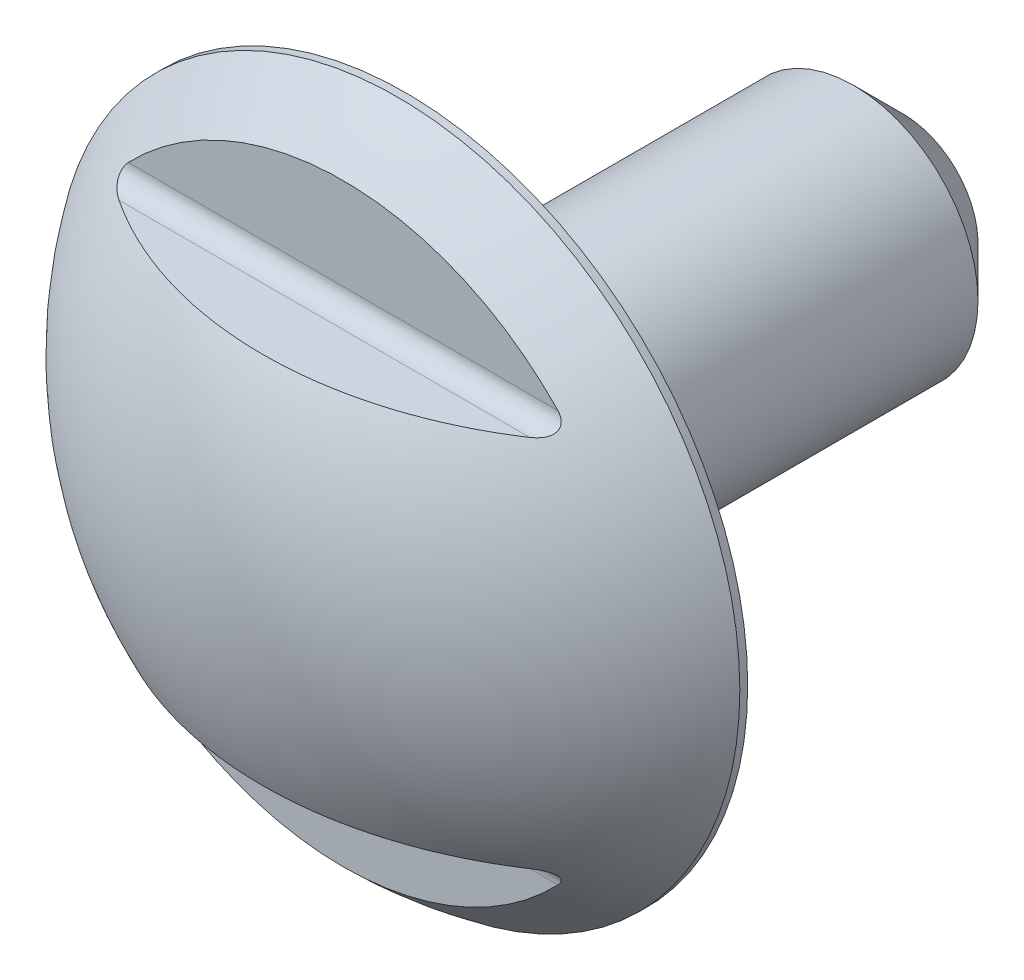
ISO-10303-21;
HEADER;
FILE_DESCRIPTION(('STEP AP214'),'2;1');
FILE_NAME('part.step','',(''),(''),'','','');
FILE_SCHEMA(('AUTOMOTIVE_DESIGN { 1 0 10303 214 1 1 1 1 }'));
ENDSEC;
DATA;
#1=APPLICATION_CONTEXT('core data for automotive mechanical design processes');
#2=APPLICATION_PROTOCOL_DEFINITION('international standard','automotive_design',2000,#1);
#3=PRODUCT_CONTEXT('',#1,'mechanical');
#4=PRODUCT('Part','Part','',(#3));
#5=PRODUCT_RELATED_PRODUCT_CATEGORY('part','',(#4));
#6=PRODUCT_DEFINITION_FORMATION('','',#4);
#7=PRODUCT_DEFINITION_CONTEXT('part definition',#1,'design');
#8=PRODUCT_DEFINITION('design','',#6,#7);
#9=PRODUCT_DEFINITION_SHAPE('','',#8);
#10=(LENGTH_UNIT() NAMED_UNIT(*) SI_UNIT(.MILLI.,.METRE.));
#11=(NAMED_UNIT(*) PLANE_ANGLE_UNIT() SI_UNIT($,.RADIAN.));
#12=(NAMED_UNIT(*) SI_UNIT($,.STERADIAN.) SOLID_ANGLE_UNIT());
#13=UNCERTAINTY_MEASURE_WITH_UNIT(LENGTH_MEASURE(1.E-05),#10,'distance_accuracy_value','');
#14=(GEOMETRIC_REPRESENTATION_CONTEXT(3) GLOBAL_UNCERTAINTY_ASSIGNED_CONTEXT((#13)) GLOBAL_UNIT_ASSIGNED_CONTEXT((#10,
#11,#12)) REPRESENTATION_CONTEXT('',''));
#15=CARTESIAN_POINT('',(0.,0.,0.));
#16=DIRECTION('',(0.,0.,1.));
#17=DIRECTION('',(1.,0.,0.));
#18=AXIS2_PLACEMENT_3D('',#15,#16,#17);
#19=CARTESIAN_POINT('',(0.,0.,-6.));
#20=DIRECTION('',(0.,0.,-1.));
#21=DIRECTION('',(1.,0.,0.));
#22=AXIS2_PLACEMENT_3D('',#19,#20,#21);
#23=CYLINDRICAL_SURFACE('',#22,5.5);
#24=CARTESIAN_POINT('',(0.,0.,0.));
#25=DIRECTION('',(0.,0.,-1.));
#26=DIRECTION('',(1.,0.,0.));
#27=AXIS2_PLACEMENT_3D('',#24,#25,#26);
#28=CIRCLE('',#27,5.5);
#29=CARTESIAN_POINT('',(5.5,0.,0.));
#30=VERTEX_POINT('',#29);
#31=EDGE_CURVE('E59',#30,#30,#28,.T.);
#32=ORIENTED_EDGE('',*,*,#31,.F.);
#33=EDGE_LOOP('',(#32));
#34=FACE_BOUND('',#33,.T.);
#35=CARTESIAN_POINT('',(0.,0.,0.126225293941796));
#36=DIRECTION('',(0.,0.,1.));
#37=DIRECTION('',(-1.,0.,0.));
#38=AXIS2_PLACEMENT_3D('',#35,#36,#37);
#39=CIRCLE('',#38,5.5);
#40=CARTESIAN_POINT('',(-5.5,0.,0.126225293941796));
#41=VERTEX_POINT('',#40);
#42=EDGE_CURVE('E144',#41,#41,#39,.T.);
#43=ORIENTED_EDGE('',*,*,#42,.F.);
#44=EDGE_LOOP('',(#43));
#45=FACE_BOUND('',#44,.T.);
#46=ADVANCED_FACE('F14',(#34,#45),#23,.T.);
#47=CARTESIAN_POINT('',(0.,-5.5,0.));
#48=DIRECTION('',(0.,0.,1.));
#49=DIRECTION('',(-1.,0.,0.));
#50=AXIS2_PLACEMENT_3D('',#47,#48,#49);
#51=PLANE('',#50);
#52=CARTESIAN_POINT('',(0.,0.,0.));
#53=DIRECTION('',(0.,0.,-1.));
#54=DIRECTION('',(1.,0.,0.));
#55=AXIS2_PLACEMENT_3D('',#52,#53,#54);
#56=CIRCLE('',#55,1.85);
#57=CARTESIAN_POINT('',(1.85,0.,0.));
#58=VERTEX_POINT('',#57);
#59=EDGE_CURVE('E158',#58,#58,#56,.T.);
#60=ORIENTED_EDGE('',*,*,#59,.F.);
#61=EDGE_LOOP('',(#60));
#62=FACE_BOUND('',#61,.T.);
#63=ORIENTED_EDGE('',*,*,#31,.T.);
#64=EDGE_LOOP('',(#63));
#65=FACE_BOUND('',#64,.T.);
#66=ADVANCED_FACE('F106',(#62,#65),#51,.F.);
#67=CARTESIAN_POINT('',(0.,0.,-0.4));
#68=DIRECTION('',(0.,0.,-1.));
#69=DIRECTION('',(1.,0.,0.));
#70=AXIS2_PLACEMENT_3D('',#67,#68,#69);
#71=TOROIDAL_SURFACE('',#70,1.85,0.4);
#72=CARTESIAN_POINT('',(0.,0.,-0.4));
#73=DIRECTION('',(0.,0.,-1.));
#74=DIRECTION('',(1.,0.,0.));
#75=AXIS2_PLACEMENT_3D('',#72,#73,#74);
#76=CIRCLE('',#75,1.45);
#77=CARTESIAN_POINT('',(1.45,0.,-0.4));
#78=VERTEX_POINT('',#77);
#79=EDGE_CURVE('E155',#78,#78,#76,.T.);
#80=ORIENTED_EDGE('',*,*,#79,.F.);
#81=EDGE_LOOP('',(#80));
#82=FACE_BOUND('',#81,.T.);
#83=ORIENTED_EDGE('',*,*,#59,.T.);
#84=EDGE_LOOP('',(#83));
#85=FACE_BOUND('',#84,.T.);
#86=ADVANCED_FACE('F111',(#82,#85),#71,.F.);
#87=CARTESIAN_POINT('',(0.,0.,-6.));
#88=DIRECTION('',(0.,0.,-1.));
#89=DIRECTION('',(1.,0.,0.));
#90=AXIS2_PLACEMENT_3D('',#87,#88,#89);
#91=CYLINDRICAL_SURFACE('',#90,1.45);
#92=CARTESIAN_POINT('',(0.,0.,-0.440192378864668));
#93=DIRECTION('',(0.,0.,-1.));
#94=DIRECTION('',(1.,0.,0.));
#95=AXIS2_PLACEMENT_3D('',#92,#93,#94);
#96=CIRCLE('',#95,1.45);
#97=CARTESIAN_POINT('',(1.45,0.,-0.440192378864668));
#98=VERTEX_POINT('',#97);
#99=EDGE_CURVE('E147',#98,#98,#96,.T.);
#100=ORIENTED_EDGE('',*,*,#99,.F.);
#101=EDGE_LOOP('',(#100));
#102=FACE_BOUND('',#101,.T.);
#103=ORIENTED_EDGE('',*,*,#79,.T.);
#104=EDGE_LOOP('',(#103));
#105=FACE_BOUND('',#104,.T.);
#106=ADVANCED_FACE('F119',(#102,#105),#91,.T.);
#107=CARTESIAN_POINT('',(0.,0.,-0.44019237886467));
#108=DIRECTION('',(0.,0.,-1.));
#109=DIRECTION('',(1.,0.,0.));
#110=AXIS2_PLACEMENT_3D('',#107,#108,#109);
#111=TOROIDAL_SURFACE('',#110,1.85,0.399999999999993);
#112=CARTESIAN_POINT('',(0.,0.,-0.640192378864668));
#113=DIRECTION('',(0.,0.,-1.));
#114=DIRECTION('',(1.,0.,0.));
#115=AXIS2_PLACEMENT_3D('',#112,#113,#114);
#116=CIRCLE('',#115,1.50358983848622);
#117=CARTESIAN_POINT('',(1.50358983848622,0.,-0.640192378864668));
#118=VERTEX_POINT('',#117);
#119=EDGE_CURVE('E143',#118,#118,#116,.T.);
#120=ORIENTED_EDGE('',*,*,#119,.F.);
#121=EDGE_LOOP('',(#120));
#122=FACE_BOUND('',#121,.T.);
#123=ORIENTED_EDGE('',*,*,#99,.T.);
#124=EDGE_LOOP('',(#123));
#125=FACE_BOUND('',#124,.T.);
#126=ADVANCED_FACE('F123',(#122,#125),#111,.F.);
#127=CARTESIAN_POINT('',(0.,0.,-0.640192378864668));
#128=DIRECTION('',(0.,0.,-1.));
#129=DIRECTION('',(1.,0.,0.));
#130=AXIS2_PLACEMENT_3D('',#127,#128,#129);
#131=CONICAL_SURFACE('',#130,1.50358983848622,0.523598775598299);
#132=CARTESIAN_POINT('',(0.,0.,-1.5));
#133=DIRECTION('',(0.,0.,-1.));
#134=DIRECTION('',(1.,0.,0.));
#135=AXIS2_PLACEMENT_3D('',#132,#133,#134);
#136=CIRCLE('',#135,2.);
#137=CARTESIAN_POINT('',(2.,0.,-1.5));
#138=VERTEX_POINT('',#137);
#139=EDGE_CURVE('E142',#138,#138,#136,.T.);
#140=ORIENTED_EDGE('',*,*,#139,.F.);
#141=EDGE_LOOP('',(#140));
#142=FACE_BOUND('',#141,.T.);
#143=ORIENTED_EDGE('',*,*,#119,.T.);
#144=EDGE_LOOP('',(#143));
#145=FACE_BOUND('',#144,.T.);
#146=ADVANCED_FACE('F127',(#142,#145),#131,.T.);
#147=CARTESIAN_POINT('',(0.,0.,-6.));
#148=DIRECTION('',(0.,0.,-1.));
#149=DIRECTION('',(1.,0.,0.));
#150=AXIS2_PLACEMENT_3D('',#147,#148,#149);
#151=CYLINDRICAL_SURFACE('',#150,2.);
#152=CARTESIAN_POINT('',(0.,0.,-7.2));
#153=DIRECTION('',(0.,0.,-1.));
#154=DIRECTION('',(-1.,0.,0.));
#155=AXIS2_PLACEMENT_3D('',#152,#153,#154);
#156=CIRCLE('',#155,2.);
#157=CARTESIAN_POINT('',(-2.,0.,-7.2));
#158=VERTEX_POINT('',#157);
#159=EDGE_CURVE('E9',#158,#158,#156,.F.);
#160=ORIENTED_EDGE('',*,*,#159,.T.);
#161=EDGE_LOOP('',(#160));
#162=FACE_BOUND('',#161,.T.);
#163=ORIENTED_EDGE('',*,*,#139,.T.);
#164=EDGE_LOOP('',(#163));
#165=FACE_BOUND('',#164,.T.);
#166=ADVANCED_FACE('F130',(#162,#165),#151,.T.);
#167=CARTESIAN_POINT('',(0.,0.,-3.7));
#168=DIRECTION('',(0.,0.,1.));
#169=DIRECTION('',(0.,-1.,0.));
#170=AXIS2_PLACEMENT_3D('',#167,#168,#169);
#171=SPHERICAL_SURFACE('',#170,6.7);
#172=CARTESIAN_POINT('',(0.,3.,-3.7));
#173=DIRECTION('',(0.,-1.,0.));
#174=DIRECTION('',(0.,0.,1.));
#175=AXIS2_PLACEMENT_3D('',#172,#173,#174);
#176=CIRCLE('',#175,5.99082632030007);
#177=CARTESIAN_POINT('',(-3.3,3.,1.3));
#178=VERTEX_POINT('',#177);
#179=CARTESIAN_POINT('',(3.3,3.,1.3));
#180=VERTEX_POINT('',#179);
#181=EDGE_CURVE('E175',#178,#180,#176,.F.);
#182=ORIENTED_EDGE('',*,*,#181,.F.);
#183=CARTESIAN_POINT('',(-3.45089543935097,3.3002,1.00000006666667));
#184=CARTESIAN_POINT('',(-3.46018087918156,3.29048831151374,1.00000237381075));
#185=CARTESIAN_POINT('',(-3.46914612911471,3.28037875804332,1.00045993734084));
#186=CARTESIAN_POINT('',(-3.48611932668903,3.25927546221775,1.00258239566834));
#187=CARTESIAN_POINT('',(-3.49411182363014,3.24827117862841,1.0042643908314));
#188=CARTESIAN_POINT('',(-3.50706084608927,3.2278869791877,1.00865037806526));
#189=CARTESIAN_POINT('',(-3.51230406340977,3.21863403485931,1.01107565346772));
#190=CARTESIAN_POINT('',(-3.52144320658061,3.19986480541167,1.01703507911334));
#191=CARTESIAN_POINT('',(-3.52534582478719,3.19035009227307,1.0205635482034));
#192=CARTESIAN_POINT('',(-3.53092309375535,3.17302031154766,1.0280654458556));
#193=CARTESIAN_POINT('',(-3.53287341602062,3.16520988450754,1.03184218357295));
#194=CARTESIAN_POINT('',(-3.53549615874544,3.14978225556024,1.04017058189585));
#195=CARTESIAN_POINT('',(-3.53616853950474,3.1421650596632,1.04472226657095));
#196=CARTESIAN_POINT('',(-3.53617075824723,3.12736045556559,1.05449173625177));
#197=CARTESIAN_POINT('',(-3.53549939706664,3.12017343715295,1.05971011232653));
#198=CARTESIAN_POINT('',(-3.53287562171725,3.10643298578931,1.07063337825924));
#199=CARTESIAN_POINT('',(-3.53092247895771,3.09987991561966,1.07633854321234));
#200=CARTESIAN_POINT('',(-3.52529259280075,3.08604577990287,1.08944195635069));
#201=CARTESIAN_POINT('',(-3.52131606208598,3.07896325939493,1.0969197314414));
#202=CARTESIAN_POINT('',(-3.51201340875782,3.06596918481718,1.11203868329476));
#203=CARTESIAN_POINT('',(-3.50668549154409,3.06005920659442,1.11968006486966));
#204=CARTESIAN_POINT('',(-3.49206581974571,3.04659813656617,1.13880050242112));
#205=CARTESIAN_POINT('',(-3.48213266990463,3.03973031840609,1.1502644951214));
#206=CARTESIAN_POINT('',(-3.460749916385,3.02796447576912,1.1728760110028));
#207=CARTESIAN_POINT('',(-3.44929059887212,3.02307995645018,1.18402089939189));
#208=CARTESIAN_POINT('',(-3.42676990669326,3.0153950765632,1.20457526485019));
#209=CARTESIAN_POINT('',(-3.41581348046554,3.01241999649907,1.21403723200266));
#210=CARTESIAN_POINT('',(-3.39333574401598,3.00751675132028,1.23257885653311));
#211=CARTESIAN_POINT('',(-3.38181362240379,3.00559014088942,1.24165792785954));
#212=CARTESIAN_POINT('',(-3.35866326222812,3.00265798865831,1.25919687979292));
#213=CARTESIAN_POINT('',(-3.34704513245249,3.00163031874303,1.26766662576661));
#214=CARTESIAN_POINT('',(-3.32355151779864,3.00030227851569,1.28421487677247));
#215=CARTESIAN_POINT('',(-3.31167705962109,2.99999941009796,1.29229463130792));
#216=CARTESIAN_POINT('',(-3.29969688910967,3.00000006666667,1.3002));
#217=B_SPLINE_CURVE_WITH_KNOTS('',3,(#183,#184,#185,#186,#187,#188,#189,#190,#191,#192,#193,
#194,#195,#196,#197,#198,#199,#200,#201,#202,#203,#204,#205,#206,#207,#208,#209,#210,#211,#212,
#213,#214,#215,#216),.UNSPECIFIED.,.F.,.F.,(4,2,2,2,2,2,2,2,2,2,2,2,2,2,2,2,4),(0.,
0.0403974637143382,0.0813702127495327,0.113978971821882,0.146422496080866,0.172983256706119,
0.199544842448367,0.226130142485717,0.252730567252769,0.28566873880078,0.318650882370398,
0.368325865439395,0.418333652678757,0.462609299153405,0.506950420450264,0.550166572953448,
0.593233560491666),.UNSPECIFIED.);
#218=CARTESIAN_POINT('',(-3.45108678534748,3.3,1.));
#219=VERTEX_POINT('',#218);
#220=EDGE_CURVE('E180',#219,#178,#217,.T.);
#221=ORIENTED_EDGE('',*,*,#220,.F.);
#222=CARTESIAN_POINT('',(0.,0.,1.));
#223=DIRECTION('',(0.,0.,-1.));
#224=DIRECTION('',(0.,-1.,0.));
#225=AXIS2_PLACEMENT_3D('',#222,#223,#224);
#226=CIRCLE('',#225,4.77493455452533);
#227=CARTESIAN_POINT('',(3.45108678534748,3.3,1.));
#228=VERTEX_POINT('',#227);
#229=EDGE_CURVE('E73',#228,#219,#226,.F.);
#230=ORIENTED_EDGE('',*,*,#229,.F.);
#231=CARTESIAN_POINT('',(3.29969688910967,3.00000006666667,1.3002));
#232=CARTESIAN_POINT('',(3.31430711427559,3.00000454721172,1.29055614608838));
#233=CARTESIAN_POINT('',(3.32876926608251,3.00045317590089,1.28065091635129));
#234=CARTESIAN_POINT('',(3.35734920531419,3.00246823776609,1.26021193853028));
#235=CARTESIAN_POINT('',(3.37146290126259,3.00404436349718,1.24967347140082));
#236=CARTESIAN_POINT('',(3.39935085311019,3.00860290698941,1.22778339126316));
#237=CARTESIAN_POINT('',(3.41311009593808,3.01161648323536,1.21641873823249));
#238=CARTESIAN_POINT('',(3.43957104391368,3.01940778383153,1.19314330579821));
#239=CARTESIAN_POINT('',(3.45227673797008,3.02417844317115,1.18123487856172));
#240=CARTESIAN_POINT('',(3.47174047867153,3.03379937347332,1.1613999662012));
#241=CARTESIAN_POINT('',(3.47897095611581,3.03797889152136,1.15361468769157));
#242=CARTESIAN_POINT('',(3.49256263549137,3.0473758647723,1.13793714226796));
#243=CARTESIAN_POINT('',(3.49892598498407,3.05259067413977,1.1300451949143));
#244=CARTESIAN_POINT('',(3.51057224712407,3.06427793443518,1.11416825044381));
#245=CARTESIAN_POINT('',(3.51584074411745,3.07076521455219,1.1061833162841));
#246=CARTESIAN_POINT('',(3.52477894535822,3.08503547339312,1.09047194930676));
#247=CARTESIAN_POINT('',(3.52845172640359,3.09281591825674,1.08274504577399));
#248=CARTESIAN_POINT('',(3.53315073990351,3.10756914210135,1.06968936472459));
#249=CARTESIAN_POINT('',(3.53459973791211,3.11429041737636,1.06422885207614));
#250=CARTESIAN_POINT('',(3.53621492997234,3.1282846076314,1.05385062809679));
#251=CARTESIAN_POINT('',(3.53638173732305,3.13555725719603,1.04893265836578));
#252=CARTESIAN_POINT('',(3.53541714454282,3.15043972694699,1.03979236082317));
#253=CARTESIAN_POINT('',(3.53428616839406,3.15804943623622,1.03556980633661));
#254=CARTESIAN_POINT('',(3.5308278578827,3.17337877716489,1.02789576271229));
#255=CARTESIAN_POINT('',(3.52850021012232,3.18109843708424,1.02444447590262));
#256=CARTESIAN_POINT('',(3.52190588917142,3.19892583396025,1.01732823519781));
#257=CARTESIAN_POINT('',(3.51725673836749,3.20900531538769,1.01394983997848));
#258=CARTESIAN_POINT('',(3.50657915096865,3.22879085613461,1.0083911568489));
#259=CARTESIAN_POINT('',(3.50054441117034,3.23849496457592,1.00621650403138));
#260=CARTESIAN_POINT('',(3.48758435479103,3.25721720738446,1.00291628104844));
#261=CARTESIAN_POINT('',(3.48067533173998,3.26624400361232,1.00177403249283));
#262=CARTESIAN_POINT('',(3.46621678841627,3.28366499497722,1.0003205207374));
#263=CARTESIAN_POINT('',(3.45867581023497,3.29206540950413,0.999999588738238));
#264=CARTESIAN_POINT('',(3.45089543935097,3.3002,1.00000006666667));
#265=B_SPLINE_CURVE_WITH_KNOTS('',3,(#231,#232,#233,#234,#235,#236,#237,#238,#239,#240,#241,
#242,#243,#244,#245,#246,#247,#248,#249,#250,#251,#252,#253,#254,#255,#256,#257,#258,#259,#260,
#261,#262,#263,#264),.UNSPECIFIED.,.F.,.F.,(4,2,2,2,2,2,2,2,2,2,2,2,2,2,2,2,4),(0.,
0.0525412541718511,0.105539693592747,0.15974309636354,0.213730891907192,0.247920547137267,
0.28202392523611,0.316551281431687,0.351011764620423,0.377234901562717,0.403445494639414,
0.429647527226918,0.455856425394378,0.490472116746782,0.525248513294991,0.55945250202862,
0.593251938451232),.UNSPECIFIED.);
#266=EDGE_CURVE('E181',#180,#228,#265,.T.);
#267=ORIENTED_EDGE('',*,*,#266,.F.);
#268=EDGE_LOOP('',(#182,#221,#230,#267));
#269=FACE_BOUND('',#268,.T.);
#270=CARTESIAN_POINT('',(0.,0.,1.));
#271=DIRECTION('',(0.,0.,-1.));
#272=DIRECTION('',(0.,-1.,0.));
#273=AXIS2_PLACEMENT_3D('',#270,#271,#272);
#274=CIRCLE('',#273,4.77493455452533);
#275=CARTESIAN_POINT('',(-3.4510867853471,-3.3,1.));
#276=VERTEX_POINT('',#275);
#277=CARTESIAN_POINT('',(3.45108678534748,-3.3,1.));
#278=VERTEX_POINT('',#277);
#279=EDGE_CURVE('E71',#276,#278,#274,.F.);
#280=ORIENTED_EDGE('',*,*,#279,.F.);
#281=CARTESIAN_POINT('',(-3.29969688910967,-3.00000006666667,1.3002));
#282=CARTESIAN_POINT('',(-3.31430711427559,-3.00000454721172,1.29055614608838));
#283=CARTESIAN_POINT('',(-3.32876926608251,-3.00045317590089,1.2806509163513));
#284=CARTESIAN_POINT('',(-3.35734920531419,-3.00246823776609,1.26021193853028));
#285=CARTESIAN_POINT('',(-3.37146290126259,-3.00404436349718,1.24967347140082));
#286=CARTESIAN_POINT('',(-3.39935085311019,-3.00860290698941,1.22778339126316));
#287=CARTESIAN_POINT('',(-3.41311009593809,-3.01161648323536,1.21641873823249));
#288=CARTESIAN_POINT('',(-3.43957104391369,-3.01940778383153,1.1931433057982));
#289=CARTESIAN_POINT('',(-3.45227673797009,-3.02417844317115,1.18123487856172));
#290=CARTESIAN_POINT('',(-3.47174047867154,-3.03379937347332,1.16139996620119));
#291=CARTESIAN_POINT('',(-3.47897095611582,-3.03797889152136,1.15361468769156));
#292=CARTESIAN_POINT('',(-3.49256263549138,-3.04737586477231,1.13793714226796));
#293=CARTESIAN_POINT('',(-3.49892598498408,-3.05259067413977,1.1300451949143));
#294=CARTESIAN_POINT('',(-3.51057224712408,-3.06427793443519,1.1141682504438));
#295=CARTESIAN_POINT('',(-3.51584074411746,-3.07076521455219,1.10618331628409));
#296=CARTESIAN_POINT('',(-3.52477894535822,-3.08503547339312,1.09047194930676));
#297=CARTESIAN_POINT('',(-3.5284517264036,-3.09281591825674,1.08274504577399));
#298=CARTESIAN_POINT('',(-3.53315073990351,-3.10756914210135,1.06968936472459));
#299=CARTESIAN_POINT('',(-3.53459973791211,-3.11429041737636,1.06422885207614));
#300=CARTESIAN_POINT('',(-3.53621492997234,-3.1282846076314,1.05385062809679));
#301=CARTESIAN_POINT('',(-3.53638173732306,-3.13555725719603,1.04893265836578));
#302=CARTESIAN_POINT('',(-3.53541714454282,-3.150439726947,1.03979236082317));
#303=CARTESIAN_POINT('',(-3.53428616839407,-3.15804943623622,1.03556980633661));
#304=CARTESIAN_POINT('',(-3.5308278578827,-3.17337877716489,1.02789576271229));
#305=CARTESIAN_POINT('',(-3.52850021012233,-3.18109843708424,1.02444447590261));
#306=CARTESIAN_POINT('',(-3.52190588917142,-3.19892583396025,1.0173282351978));
#307=CARTESIAN_POINT('',(-3.5172567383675,-3.20900531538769,1.01394983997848));
#308=CARTESIAN_POINT('',(-3.50657915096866,-3.22879085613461,1.0083911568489));
#309=CARTESIAN_POINT('',(-3.50054441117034,-3.23849496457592,1.00621650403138));
#310=CARTESIAN_POINT('',(-3.48758435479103,-3.25721720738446,1.00291628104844));
#311=CARTESIAN_POINT('',(-3.48067533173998,-3.26624400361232,1.00177403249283));
#312=CARTESIAN_POINT('',(-3.46621678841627,-3.28366499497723,1.0003205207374));
#313=CARTESIAN_POINT('',(-3.45867581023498,-3.29206540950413,0.999999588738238));
#314=CARTESIAN_POINT('',(-3.45089543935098,-3.3002,1.00000006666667));
#315=B_SPLINE_CURVE_WITH_KNOTS('',3,(#281,#282,#283,#284,#285,#286,#287,#288,#289,#290,#291,
#292,#293,#294,#295,#296,#297,#298,#299,#300,#301,#302,#303,#304,#305,#306,#307,#308,#309,#310,
#311,#312,#313,#314),.UNSPECIFIED.,.F.,.F.,(4,2,2,2,2,2,2,2,2,2,2,2,2,2,2,2,4),(0.,
0.0525412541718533,0.105539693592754,0.159743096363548,0.213730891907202,0.247920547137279,
0.282023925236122,0.316551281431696,0.351011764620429,0.377234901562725,0.403445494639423,
0.429647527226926,0.455856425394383,0.490472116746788,0.525248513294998,0.559452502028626,
0.593251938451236),.UNSPECIFIED.);
#316=CARTESIAN_POINT('',(-3.3,-3.,1.3));
#317=VERTEX_POINT('',#316);
#318=EDGE_CURVE('E64',#317,#276,#315,.T.);
#319=ORIENTED_EDGE('',*,*,#318,.F.);
#320=CARTESIAN_POINT('',(0.,-3.,-3.7));
#321=DIRECTION('',(0.,1.,0.));
#322=DIRECTION('',(0.,0.,-1.));
#323=AXIS2_PLACEMENT_3D('',#320,#321,#322);
#324=CIRCLE('',#323,5.99082632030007);
#325=CARTESIAN_POINT('',(3.3,-3.,1.3));
#326=VERTEX_POINT('',#325);
#327=EDGE_CURVE('E53',#326,#317,#324,.F.);
#328=ORIENTED_EDGE('',*,*,#327,.F.);
#329=CARTESIAN_POINT('',(3.45089543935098,-3.3002,1.00000006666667));
#330=CARTESIAN_POINT('',(3.46018087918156,-3.29048831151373,1.00000237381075));
#331=CARTESIAN_POINT('',(3.46914612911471,-3.28037875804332,1.00045993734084));
#332=CARTESIAN_POINT('',(3.48611932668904,-3.25927546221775,1.00258239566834));
#333=CARTESIAN_POINT('',(3.49411182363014,-3.24827117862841,1.0042643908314));
#334=CARTESIAN_POINT('',(3.50706084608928,-3.2278869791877,1.00865037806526));
#335=CARTESIAN_POINT('',(3.51230406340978,-3.21863403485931,1.01107565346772));
#336=CARTESIAN_POINT('',(3.52144320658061,-3.19986480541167,1.01703507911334));
#337=CARTESIAN_POINT('',(3.52534582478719,-3.19035009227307,1.0205635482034));
#338=CARTESIAN_POINT('',(3.53092309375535,-3.17302031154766,1.0280654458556));
#339=CARTESIAN_POINT('',(3.53287341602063,-3.16520988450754,1.03184218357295));
#340=CARTESIAN_POINT('',(3.53549615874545,-3.14978225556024,1.04017058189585));
#341=CARTESIAN_POINT('',(3.53616853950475,-3.14216505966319,1.04472226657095));
#342=CARTESIAN_POINT('',(3.53617075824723,-3.12736045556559,1.05449173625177));
#343=CARTESIAN_POINT('',(3.53549939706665,-3.12017343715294,1.05971011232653));
#344=CARTESIAN_POINT('',(3.53287562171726,-3.10643298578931,1.07063337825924));
#345=CARTESIAN_POINT('',(3.53092247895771,-3.09987991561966,1.07633854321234));
#346=CARTESIAN_POINT('',(3.52529259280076,-3.08604577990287,1.08944195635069));
#347=CARTESIAN_POINT('',(3.52131606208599,-3.07896325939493,1.0969197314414));
#348=CARTESIAN_POINT('',(3.51201340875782,-3.06596918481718,1.11203868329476));
#349=CARTESIAN_POINT('',(3.50668549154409,-3.06005920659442,1.11968006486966));
#350=CARTESIAN_POINT('',(3.49206581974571,-3.04659813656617,1.13880050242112));
#351=CARTESIAN_POINT('',(3.48213266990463,-3.03973031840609,1.1502644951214));
#352=CARTESIAN_POINT('',(3.460749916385,-3.02796447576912,1.1728760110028));
#353=CARTESIAN_POINT('',(3.44929059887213,-3.02307995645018,1.18402089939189));
#354=CARTESIAN_POINT('',(3.42676990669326,-3.0153950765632,1.20457526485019));
#355=CARTESIAN_POINT('',(3.41581348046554,-3.01241999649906,1.21403723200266));
#356=CARTESIAN_POINT('',(3.39333574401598,-3.00751675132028,1.23257885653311));
#357=CARTESIAN_POINT('',(3.38181362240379,-3.00559014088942,1.24165792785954));
#358=CARTESIAN_POINT('',(3.35866326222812,-3.00265798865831,1.25919687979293));
#359=CARTESIAN_POINT('',(3.34704513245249,-3.00163031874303,1.26766662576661));
#360=CARTESIAN_POINT('',(3.32355151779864,-3.00030227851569,1.28421487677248));
#361=CARTESIAN_POINT('',(3.31167705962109,-2.99999941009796,1.29229463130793));
#362=CARTESIAN_POINT('',(3.29969688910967,-3.00000006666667,1.3002));
#363=B_SPLINE_CURVE_WITH_KNOTS('',3,(#329,#330,#331,#332,#333,#334,#335,#336,#337,#338,#339,
#340,#341,#342,#343,#344,#345,#346,#347,#348,#349,#350,#351,#352,#353,#354,#355,#356,#357,#358,
#359,#360,#361,#362),.UNSPECIFIED.,.F.,.F.,(4,2,2,2,2,2,2,2,2,2,2,2,2,2,2,2,4),(0.,
0.0403974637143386,0.0813702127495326,0.113978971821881,0.146422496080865,0.172983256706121,
0.199544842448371,0.226130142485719,0.252730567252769,0.28566873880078,0.318650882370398,
0.368325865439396,0.418333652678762,0.46260929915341,0.506950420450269,0.550166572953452,
0.593233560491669),.UNSPECIFIED.);
#364=EDGE_CURVE('E58',#278,#326,#363,.T.);
#365=ORIENTED_EDGE('',*,*,#364,.F.);
#366=EDGE_LOOP('',(#280,#319,#328,#365));
#367=FACE_BOUND('',#366,.T.);
#368=ORIENTED_EDGE('',*,*,#42,.T.);
#369=EDGE_LOOP('',(#368));
#370=FACE_BOUND('',#369,.T.);
#371=ADVANCED_FACE('F69',(#269,#367,#370),#171,.T.);
#372=CARTESIAN_POINT('',(10.,-3.3,1.));
#373=DIRECTION('',(0.,0.,-1.));
#374=DIRECTION('',(0.,-1.,0.));
#375=AXIS2_PLACEMENT_3D('',#372,#373,#374);
#376=PLANE('',#375);
#377=ORIENTED_EDGE('',*,*,#279,.T.);
#378=DIRECTION('',(-1.,0.,0.));
#379=VECTOR('',#378,1.);
#380=CARTESIAN_POINT('',(10.,-3.3,1.));
#381=LINE('',#380,#379);
#382=EDGE_CURVE('E66',#278,#276,#381,.T.);
#383=ORIENTED_EDGE('',*,*,#382,.T.);
#384=EDGE_LOOP('',(#377,#383));
#385=FACE_BOUND('',#384,.T.);
#386=ADVANCED_FACE('F93',(#385),#376,.F.);
#387=CARTESIAN_POINT('',(10.,-3.3,1.3));
#388=DIRECTION('',(-1.,0.,0.));
#389=DIRECTION('',(0.,-1.,0.));
#390=AXIS2_PLACEMENT_3D('',#387,#388,#389);
#391=CYLINDRICAL_SURFACE('',#390,0.3);
#392=ORIENTED_EDGE('',*,*,#318,.T.);
#393=ORIENTED_EDGE('',*,*,#382,.F.);
#394=ORIENTED_EDGE('',*,*,#364,.T.);
#395=DIRECTION('',(-1.,0.,0.));
#396=VECTOR('',#395,1.);
#397=CARTESIAN_POINT('',(10.,-3.,1.3));
#398=LINE('',#397,#396);
#399=EDGE_CURVE('E35',#326,#317,#398,.T.);
#400=ORIENTED_EDGE('',*,*,#399,.T.);
#401=EDGE_LOOP('',(#392,#393,#394,#400));
#402=FACE_BOUND('',#401,.T.);
#403=ADVANCED_FACE('F62',(#402),#391,.F.);
#404=CARTESIAN_POINT('',(10.,-3.,3.28679754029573));
#405=DIRECTION('',(0.,1.,0.));
#406=DIRECTION('',(0.,0.,-1.));
#407=AXIS2_PLACEMENT_3D('',#404,#405,#406);
#408=PLANE('',#407);
#409=ORIENTED_EDGE('',*,*,#327,.T.);
#410=ORIENTED_EDGE('',*,*,#399,.F.);
#411=EDGE_LOOP('',(#409,#410));
#412=FACE_BOUND('',#411,.T.);
#413=ADVANCED_FACE('F54',(#412),#408,.F.);
#414=CARTESIAN_POINT('',(10.,3.,3.28679754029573));
#415=DIRECTION('',(0.,-1.,0.));
#416=DIRECTION('',(0.,0.,1.));
#417=AXIS2_PLACEMENT_3D('',#414,#415,#416);
#418=PLANE('',#417);
#419=ORIENTED_EDGE('',*,*,#181,.T.);
#420=DIRECTION('',(-1.,0.,0.));
#421=VECTOR('',#420,1.);
#422=CARTESIAN_POINT('',(10.,3.,1.3));
#423=LINE('',#422,#421);
#424=EDGE_CURVE('E150',#180,#178,#423,.T.);
#425=ORIENTED_EDGE('',*,*,#424,.T.);
#426=EDGE_LOOP('',(#419,#425));
#427=FACE_BOUND('',#426,.T.);
#428=ADVANCED_FACE('F97',(#427),#418,.F.);
#429=CARTESIAN_POINT('',(10.,3.3,1.3));
#430=DIRECTION('',(-1.,0.,0.));
#431=DIRECTION('',(0.,-1.,0.));
#432=AXIS2_PLACEMENT_3D('',#429,#430,#431);
#433=CYLINDRICAL_SURFACE('',#432,0.3);
#434=ORIENTED_EDGE('',*,*,#266,.T.);
#435=DIRECTION('',(-1.,0.,0.));
#436=VECTOR('',#435,1.);
#437=CARTESIAN_POINT('',(10.,3.3,1.));
#438=LINE('',#437,#436);
#439=EDGE_CURVE('E28',#228,#219,#438,.T.);
#440=ORIENTED_EDGE('',*,*,#439,.T.);
#441=ORIENTED_EDGE('',*,*,#220,.T.);
#442=ORIENTED_EDGE('',*,*,#424,.F.);
#443=EDGE_LOOP('',(#434,#440,#441,#442));
#444=FACE_BOUND('',#443,.T.);
#445=ADVANCED_FACE('F102',(#444),#433,.F.);
#446=CARTESIAN_POINT('',(10.,3.3,1.));
#447=DIRECTION('',(0.,0.,-1.));
#448=DIRECTION('',(0.,-1.,0.));
#449=AXIS2_PLACEMENT_3D('',#446,#447,#448);
#450=PLANE('',#449);
#451=ORIENTED_EDGE('',*,*,#229,.T.);
#452=ORIENTED_EDGE('',*,*,#439,.F.);
#453=EDGE_LOOP('',(#451,#452));
#454=FACE_BOUND('',#453,.T.);
#455=ADVANCED_FACE('F197',(#454),#450,.F.);
#456=CARTESIAN_POINT('',(0.,0.,-8.));
#457=DIRECTION('',(0.,0.,-1.));
#458=DIRECTION('',(-1.,0.,0.));
#459=AXIS2_PLACEMENT_3D('',#456,#457,#458);
#460=PLANE('',#459);
#461=CARTESIAN_POINT('',(0.,0.,-8.));
#462=DIRECTION('',(0.,0.,-1.));
#463=DIRECTION('',(-1.,0.,0.));
#464=AXIS2_PLACEMENT_3D('',#461,#462,#463);
#465=CIRCLE('',#464,1.2);
#466=CARTESIAN_POINT('',(-1.2,0.,-8.));
#467=VERTEX_POINT('',#466);
#468=EDGE_CURVE('E22',#467,#467,#465,.T.);
#469=ORIENTED_EDGE('',*,*,#468,.T.);
#470=EDGE_LOOP('',(#469));
#471=FACE_BOUND('',#470,.T.);
#472=ADVANCED_FACE('F201',(#471),#460,.T.);
#473=CARTESIAN_POINT('',(0.,0.,-8.));
#474=DIRECTION('',(0.,0.,1.));
#475=DIRECTION('',(1.,0.,0.));
#476=AXIS2_PLACEMENT_3D('',#473,#474,#475);
#477=CONICAL_SURFACE('',#476,1.2,0.785398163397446);
#478=ORIENTED_EDGE('',*,*,#159,.F.);
#479=EDGE_LOOP('',(#478));
#480=FACE_BOUND('',#479,.T.);
#481=ORIENTED_EDGE('',*,*,#468,.F.);
#482=EDGE_LOOP('',(#481));
#483=FACE_BOUND('',#482,.T.);
#484=ADVANCED_FACE('F16',(#480,#483),#477,.T.);
#485=CLOSED_SHELL('',(#46,#66,#86,#106,#126,#146,#166,#371,#386,#403,#413,#428,#445,#455,#472,#484));
#486=MANIFOLD_SOLID_BREP('B1',#485);
#487=ADVANCED_BREP_SHAPE_REPRESENTATION('',(#18,#486),#14);
#488=SHAPE_DEFINITION_REPRESENTATION(#9,#487);
ENDSEC;
END-ISO-10303-21;
